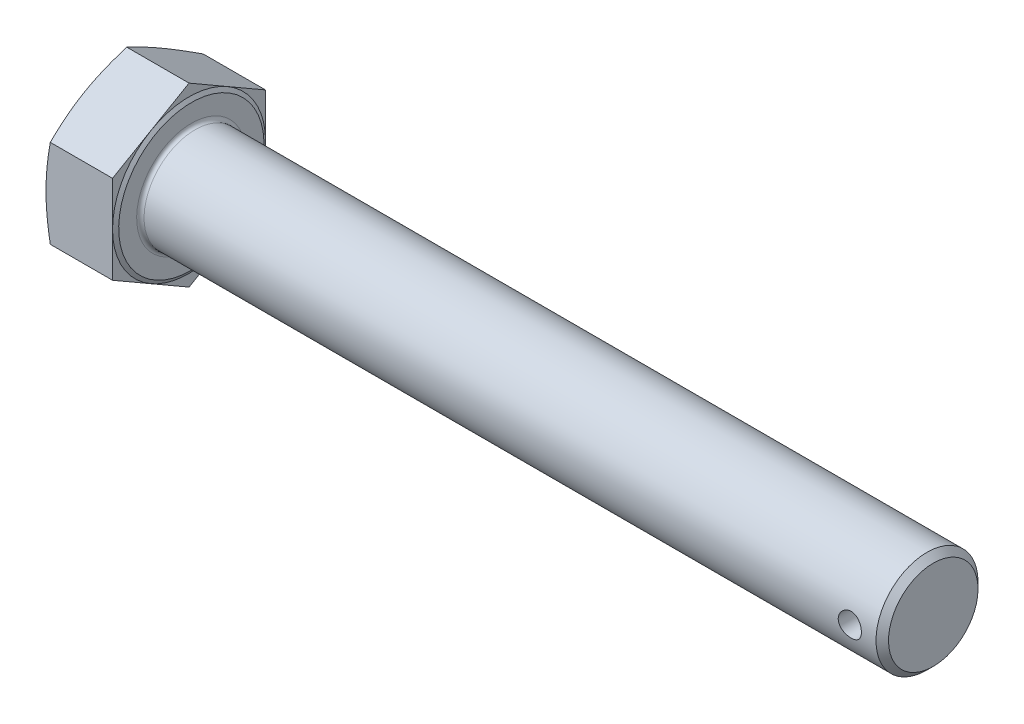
from build123d import *

# Parameters (mm, degrees)
BASEHEAD_DEPTH  = 14.35
SKETCH3_R       = 11
BASEBODY_DEPTH  = 160
CHAMFER1_SIZE   = 1.353
HEADFILLET_R    = 0.8
HOLE_DEPTH      = 177.657217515
HOLE_DEPTH_BACK = 177.657217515
SKETCH5_R       = 2.5


with BuildPart() as part:
    # Sketch-BaseHead → BaseHead (new body)
    with BuildSketch(Plane(origin=(0, 0, 0), x_dir=(0, 0, -1), z_dir=(1, 0, 0))):
        Polygon((0, -19.052558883), (16.5, -9.526279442), (16.5, 9.526279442), (0, 19.052558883), (-16.5, 9.526279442), (-16.5, -9.526279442), align=None)
    extrude(amount=BASEHEAD_DEPTH)

    # Sketch4 → HeadChamfer (revolve, cut)
    with BuildSketch(Plane(origin=(-0.264637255, -5.916896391, 0), x_dir=(0, 1, 0), z_dir=(0, 0, 1))):
        Polygon((24.969455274, -0.264637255), (22.416896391, -0.264637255), (24.969455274, -1.19369271), align=None)
    revolve(axis=Axis((-4.001564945, 0, 0), (1, 0, 0)), mode=Mode.SUBTRACT)

    # Sketch1 → Revolve1 (revolve)
    with BuildSketch(Plane(origin=(0, 0, 0), x_dir=(1, 0, 0), z_dir=(0, 1, 0)), mode=Mode.PRIVATE) as revolve1_sk:
        Polygon((14.35, 0), (14.85, 0), (14.85, 15.675), (14.35, 16.5), align=None)
    revolve(revolve1_sk.sketch.rotate(Axis((-4.001564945, 0, 0), (1, 0, 0)), 270), axis=Axis((-4.001564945, 0, 0), (1, 0, 0)))

    # Sketch3 → BaseBody (add)
    with BuildSketch(Plane(origin=(14.85, 0, 0), x_dir=(0, 0, -1), z_dir=(1, 0, 0))):
        with Locations(Location((0, 0, 0), (0, 0, 270))):
            Circle(SKETCH3_R)
    extrude(amount=BASEBODY_DEPTH)

    # Chamfer1
    chamfer1_edges = [part.edges().sort_by_distance(p)[0] for p in [
        (174.85, 11, 0),
    ]]
    chamfer(chamfer1_edges, length=CHAMFER1_SIZE)

    # HeadFillet
    headfillet_edges = [part.edges().sort_by_distance(p)[0] for p in [
        (14.85, 11, 0),
    ]]
    fillet(headfillet_edges, radius=HEADFILLET_R)

    # Sketch5 → Hole (cut, two sides: drawn at the far end of the back side and taken through both)
    with BuildSketch(Plane.XY.offset(-HOLE_DEPTH_BACK)):
        with Locations((167.85, 0)):
            Circle(SKETCH5_R)
    extrude(amount=HOLE_DEPTH + HOLE_DEPTH_BACK, mode=Mode.SUBTRACT)


solid = part.part
